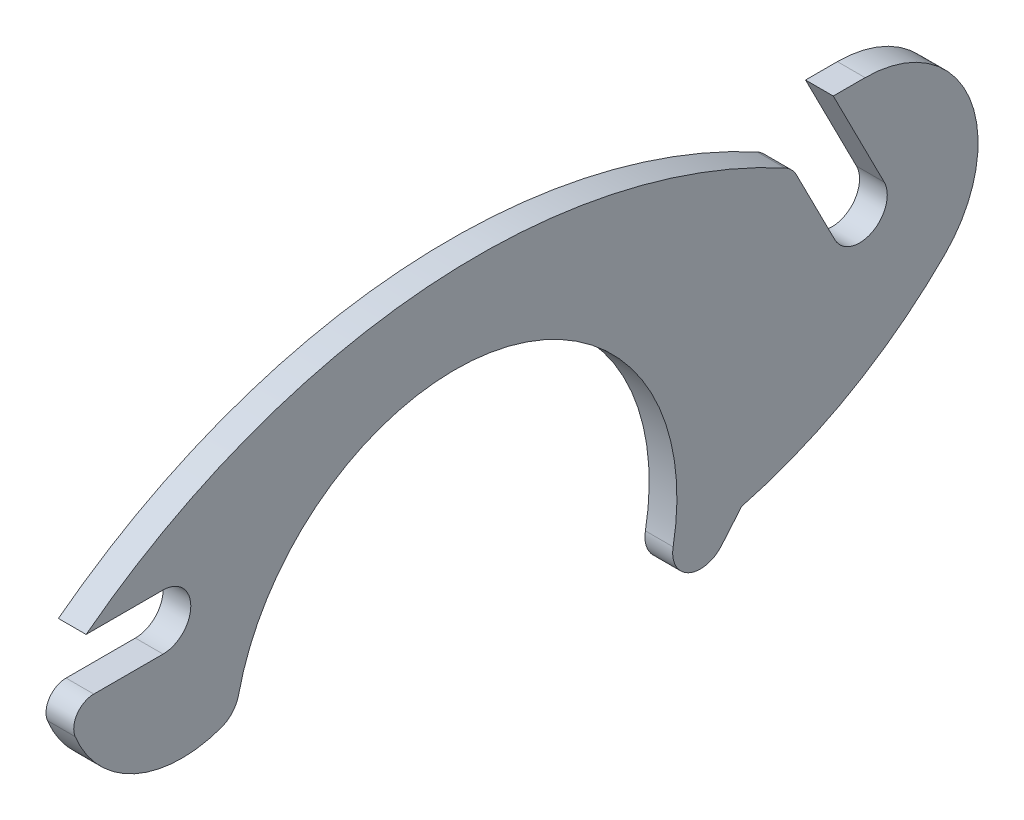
from build123d import *

# Parameters (mm, degrees)
RESSALTO_EXTRUS_O1_DEPTH = 2


with BuildPart() as part:
    # Esbo_o1 → Ressalto-extrus_o1 (new body)
    with BuildSketch(Plane(origin=(0, 0, 0), x_dir=(0, 0, -1), z_dir=(1, 0, 0))):
        with BuildLine():
            Line((47.891048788, 19.389179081), (51.568608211, 12.171562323))
            ThreePointArc((51.568608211, 12.171562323), (50.694576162, 9.481568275), (48.004582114, 10.355600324))
            Line((48.004582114, 10.355600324), (45.23762298, 15.786063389))
            ThreePointArc((45.23762298, 15.786063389), (44.888153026, 16.27331816), (44.409608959, 16.634624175))
            ThreePointArc((44.409608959, 16.634624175), (18.624536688, 22.101585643), (-6, 12.7))
            Line((-6, 12.7), (-0.449608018, 12.7))
            ThreePointArc((-0.449608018, 12.7), (1.550391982, 10.7), (-0.449608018, 8.7))
            Line((-0.449608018, 8.7), (-5.446373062, 8.7))
            ThreePointArc((-5.446373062, 8.7), (-6.646208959, 8.062107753), (-6.788438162, 6.710707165))
            ThreePointArc((-6.788438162, 6.710707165), (-2.477663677, 2.236636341), (3.730763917, 2.001023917))
            ThreePointArc((3.730763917, 2.001023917), (4.55104613, 2.557847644), (5.001705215, 3.440922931))
            ThreePointArc((5.001705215, 3.440922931), (23.834938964, 15.61229456), (36.341556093, -3))
            ThreePointArc((36.341556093, -3), (37.451213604, -5.17490134), (39.837074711, -4.656054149))
            Line((39.837074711, -4.656054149), (41.277742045, -2.945943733))
            ThreePointArc((41.277742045, -2.945943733), (49.179258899, 0.290862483), (55.956453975, 5.485139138))
            ThreePointArc((55.956453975, 5.485139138), (57.714709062, 14.363124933), (50.18816454, 19.389179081))
            Line((50.18816454, 19.389179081), (47.891048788, 19.389179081))
        make_face()
    extrude(amount=RESSALTO_EXTRUS_O1_DEPTH)


solid = part.part
